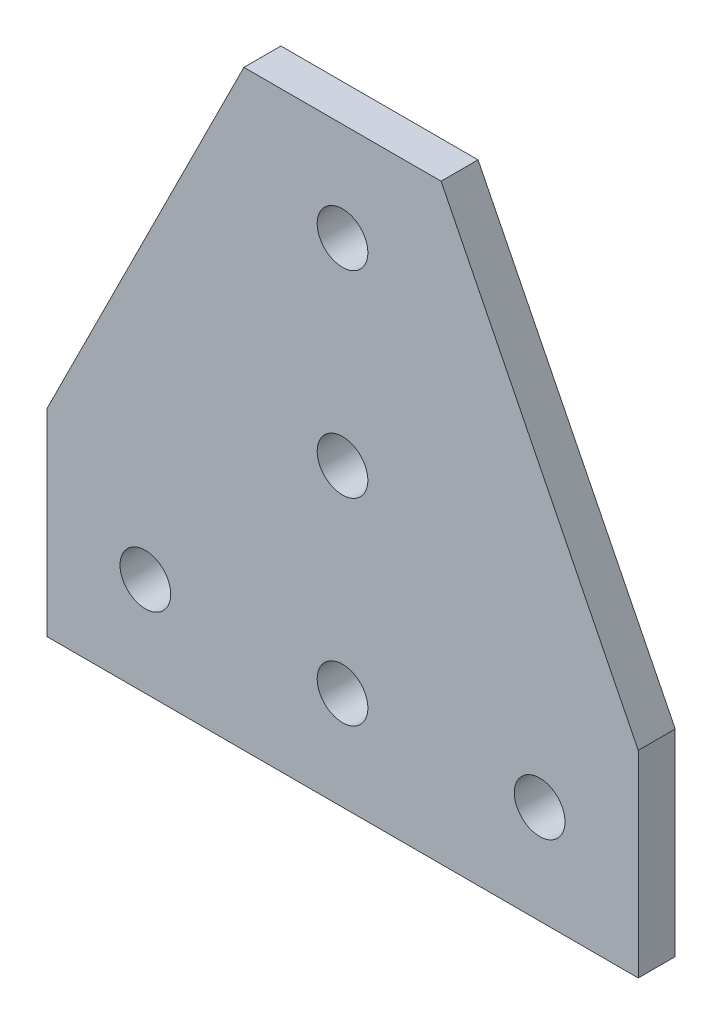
from build123d import *

# Parameters (mm, degrees)
SKETCH1_R           = 3.2639
BOSS_EXTRUDE1_DEPTH = 2.38125


with BuildPart() as part:
    # Sketch1 → Boss-Extrude1 (new, symmetric)
    with BuildSketch(Plane.XY):
        Polygon((0, 0), (0, 25.4), (25.4, 76.2), (50.8, 76.2), (76.2, 25.4), (76.2, 0), align=None)
        with Locations(Location((12.7, 12.7, 0), (0, 0, 180))):
            Circle(SKETCH1_R, mode=Mode.SUBTRACT)
        with Locations(Location((38.1, 12.7, 0), (0, 0, 180))):
            Circle(SKETCH1_R, mode=Mode.SUBTRACT)
        with Locations(Location((63.5, 12.7, 0), (0, 0, 180))):
            Circle(SKETCH1_R, mode=Mode.SUBTRACT)
        with Locations(Location((38.1, 38.1, 0), (0, 0, 180))):
            Circle(SKETCH1_R, mode=Mode.SUBTRACT)
        with Locations(Location((38.1, 63.5, 0), (0, 0, 180))):
            Circle(SKETCH1_R, mode=Mode.SUBTRACT)
    extrude(amount=BOSS_EXTRUDE1_DEPTH, both=True)


solid = part.part
